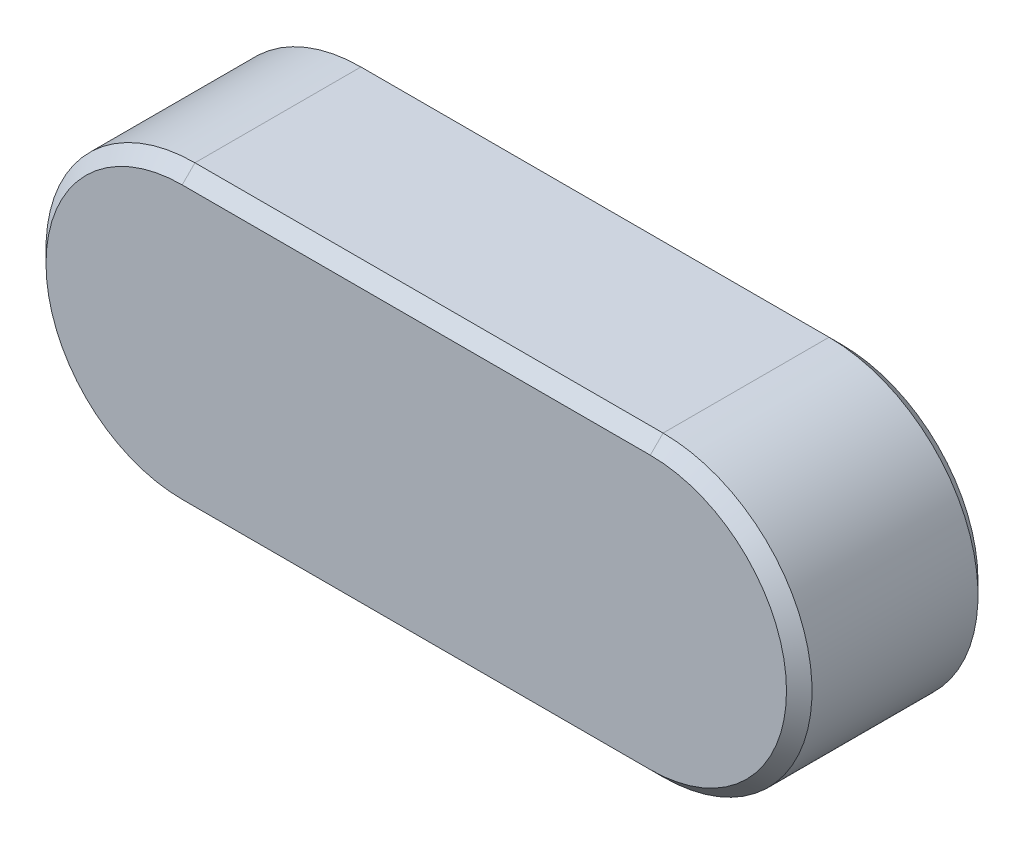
from build123d import *

# Parameters (mm, degrees)
BASEKEY_DEPTH = 4.5
CHAMFER1_SIZE = 0.6


with BuildPart() as part:
    # Sketch1 → BaseKey (new, symmetric)
    with BuildSketch(Plane.XY):
        with BuildLine():
            Line((-22, 7), (0, 7))
            ThreePointArc((0, 7), (7, 0), (0, -7))
            Line((0, -7), (-22, -7))
            ThreePointArc((-22, -7), (-29, 0), (-22, 7))
        make_face()
    extrude(amount=BASEKEY_DEPTH, both=True)

    # Chamfer1
    chamfer1_edges = [part.edges().sort_by_distance(p)[0] for p in [
        (7, 0, 4.5),
        (-11, 7, 4.5),
        (-29, 0, 4.5),
        (-11, 7, -4.5),
        (7, 0, -4.5),
        (-11, -7, -4.5),
        (-29, 0, -4.5),
        (-11, -7, 4.5),
    ]]
    chamfer(chamfer1_edges, length=CHAMFER1_SIZE)


solid = part.part
